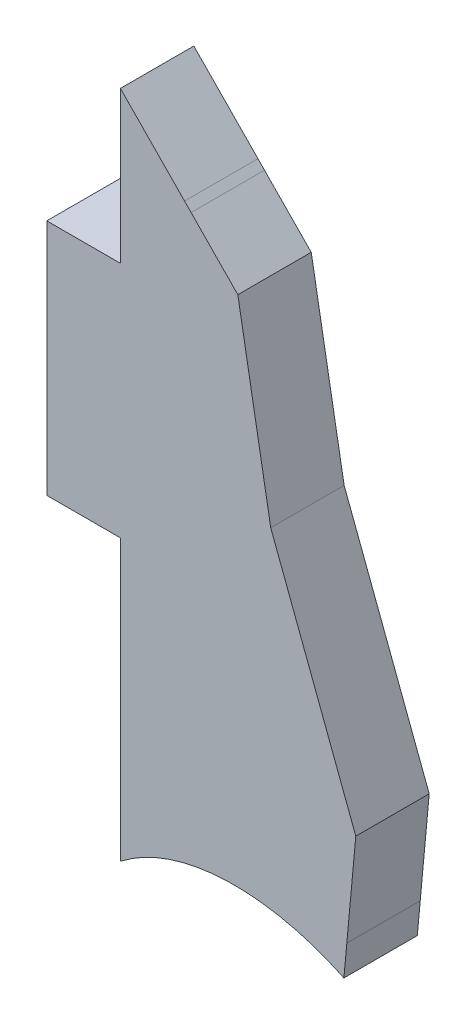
ISO-10303-21;
HEADER;
FILE_DESCRIPTION(('STEP AP214'),'2;1');
FILE_NAME('part.step','',(''),(''),'','','');
FILE_SCHEMA(('AUTOMOTIVE_DESIGN { 1 0 10303 214 1 1 1 1 }'));
ENDSEC;
DATA;
#1=APPLICATION_CONTEXT('core data for automotive mechanical design processes');
#2=APPLICATION_PROTOCOL_DEFINITION('international standard','automotive_design',2000,#1);
#3=PRODUCT_CONTEXT('',#1,'mechanical');
#4=PRODUCT('Part','Part','',(#3));
#5=PRODUCT_RELATED_PRODUCT_CATEGORY('part','',(#4));
#6=PRODUCT_DEFINITION_FORMATION('','',#4);
#7=PRODUCT_DEFINITION_CONTEXT('part definition',#1,'design');
#8=PRODUCT_DEFINITION('design','',#6,#7);
#9=PRODUCT_DEFINITION_SHAPE('','',#8);
#10=(LENGTH_UNIT() NAMED_UNIT(*) SI_UNIT(.MILLI.,.METRE.));
#11=(NAMED_UNIT(*) PLANE_ANGLE_UNIT() SI_UNIT($,.RADIAN.));
#12=(NAMED_UNIT(*) SI_UNIT($,.STERADIAN.) SOLID_ANGLE_UNIT());
#13=UNCERTAINTY_MEASURE_WITH_UNIT(LENGTH_MEASURE(1.E-05),#10,'distance_accuracy_value','');
#14=(GEOMETRIC_REPRESENTATION_CONTEXT(3) GLOBAL_UNCERTAINTY_ASSIGNED_CONTEXT((#13)) GLOBAL_UNIT_ASSIGNED_CONTEXT((#10,
#11,#12)) REPRESENTATION_CONTEXT('',''));
#15=CARTESIAN_POINT('',(0.,0.,0.));
#16=DIRECTION('',(0.,0.,1.));
#17=DIRECTION('',(1.,0.,0.));
#18=AXIS2_PLACEMENT_3D('',#15,#16,#17);
#19=CARTESIAN_POINT('',(332.35258045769,554.016328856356,3.));
#20=DIRECTION('',(-0.714557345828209,-0.699576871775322,0.));
#21=DIRECTION('',(0.699576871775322,-0.714557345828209,0.));
#22=AXIS2_PLACEMENT_3D('',#19,#20,#21);
#23=PLANE('',#22);
#24=DIRECTION('',(-0.699576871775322,0.714557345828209,0.));
#25=VECTOR('',#24,1.);
#26=CARTESIAN_POINT('',(332.35258045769,554.016328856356,0.));
#27=LINE('',#26,#25);
#28=CARTESIAN_POINT('',(332.620049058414,553.743132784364,0.));
#29=VERTEX_POINT('',#28);
#30=CARTESIAN_POINT('',(332.35258045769,554.016328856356,0.));
#31=VERTEX_POINT('',#30);
#32=EDGE_CURVE('E11',#29,#31,#27,.T.);
#33=ORIENTED_EDGE('',*,*,#32,.T.);
#34=DIRECTION('',(0.,0.,-1.));
#35=VECTOR('',#34,1.);
#36=CARTESIAN_POINT('',(332.35258045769,554.016328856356,3.));
#37=LINE('',#36,#35);
#38=CARTESIAN_POINT('',(332.35258045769,554.016328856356,3.));
#39=VERTEX_POINT('',#38);
#40=EDGE_CURVE('E394',#39,#31,#37,.T.);
#41=ORIENTED_EDGE('',*,*,#40,.F.);
#42=DIRECTION('',(-0.699576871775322,0.714557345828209,0.));
#43=VECTOR('',#42,1.);
#44=CARTESIAN_POINT('',(332.35258045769,554.016328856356,3.));
#45=LINE('',#44,#43);
#46=CARTESIAN_POINT('',(332.620049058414,553.743132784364,3.));
#47=VERTEX_POINT('',#46);
#48=EDGE_CURVE('E47',#47,#39,#45,.T.);
#49=ORIENTED_EDGE('',*,*,#48,.F.);
#50=DIRECTION('',(0.,0.,-1.));
#51=VECTOR('',#50,1.);
#52=CARTESIAN_POINT('',(332.620049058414,553.743132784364,3.));
#53=LINE('',#52,#51);
#54=EDGE_CURVE('E196',#47,#29,#53,.T.);
#55=ORIENTED_EDGE('',*,*,#54,.T.);
#56=EDGE_LOOP('',(#33,#41,#49,#55));
#57=FACE_BOUND('',#56,.T.);
#58=ADVANCED_FACE('F44',(#57),#23,.F.);
#59=CARTESIAN_POINT('',(329.732283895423,556.693340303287,3.));
#60=DIRECTION('',(-0.714636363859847,-0.699496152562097,0.));
#61=DIRECTION('',(0.699496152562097,-0.714636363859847,0.));
#62=AXIS2_PLACEMENT_3D('',#59,#60,#61);
#63=PLANE('',#62);
#64=DIRECTION('',(-0.699496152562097,0.714636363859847,0.));
#65=VECTOR('',#64,1.);
#66=CARTESIAN_POINT('',(329.732283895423,556.693340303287,0.));
#67=LINE('',#66,#65);
#68=CARTESIAN_POINT('',(329.732283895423,556.693340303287,0.));
#69=VERTEX_POINT('',#68);
#70=EDGE_CURVE('E57',#31,#69,#67,.T.);
#71=ORIENTED_EDGE('',*,*,#70,.T.);
#72=DIRECTION('',(0.,0.,-1.));
#73=VECTOR('',#72,1.);
#74=CARTESIAN_POINT('',(329.732283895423,556.693340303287,3.));
#75=LINE('',#74,#73);
#76=CARTESIAN_POINT('',(329.732283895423,556.693340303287,3.));
#77=VERTEX_POINT('',#76);
#78=EDGE_CURVE('E166',#77,#69,#75,.T.);
#79=ORIENTED_EDGE('',*,*,#78,.F.);
#80=DIRECTION('',(-0.699496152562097,0.714636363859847,0.));
#81=VECTOR('',#80,1.);
#82=CARTESIAN_POINT('',(329.732283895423,556.693340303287,3.));
#83=LINE('',#82,#81);
#84=EDGE_CURVE('E113',#39,#77,#83,.T.);
#85=ORIENTED_EDGE('',*,*,#84,.F.);
#86=ORIENTED_EDGE('',*,*,#40,.T.);
#87=EDGE_LOOP('',(#71,#79,#85,#86));
#88=FACE_BOUND('',#87,.T.);
#89=ADVANCED_FACE('F265',(#88),#63,.F.);
#90=CARTESIAN_POINT('',(329.732283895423,550.501470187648,3.));
#91=DIRECTION('',(1.,0.,0.));
#92=DIRECTION('',(0.,0.,-1.));
#93=AXIS2_PLACEMENT_3D('',#90,#91,#92);
#94=PLANE('',#93);
#95=DIRECTION('',(0.,-1.,0.));
#96=VECTOR('',#95,1.);
#97=CARTESIAN_POINT('',(329.732283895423,550.501470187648,0.));
#98=LINE('',#97,#96);
#99=CARTESIAN_POINT('',(329.732283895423,550.501470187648,0.));
#100=VERTEX_POINT('',#99);
#101=EDGE_CURVE('E162',#69,#100,#98,.T.);
#102=ORIENTED_EDGE('',*,*,#101,.T.);
#103=DIRECTION('',(0.,0.,-1.));
#104=VECTOR('',#103,1.);
#105=CARTESIAN_POINT('',(329.732283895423,550.501470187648,3.));
#106=LINE('',#105,#104);
#107=CARTESIAN_POINT('',(329.732283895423,550.501470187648,3.));
#108=VERTEX_POINT('',#107);
#109=EDGE_CURVE('E168',#108,#100,#106,.T.);
#110=ORIENTED_EDGE('',*,*,#109,.F.);
#111=DIRECTION('',(0.,-1.,0.));
#112=VECTOR('',#111,1.);
#113=CARTESIAN_POINT('',(329.732283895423,553.223870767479,3.));
#114=LINE('',#113,#112);
#115=EDGE_CURVE('E361',#77,#108,#114,.T.);
#116=ORIENTED_EDGE('',*,*,#115,.F.);
#117=ORIENTED_EDGE('',*,*,#78,.T.);
#118=EDGE_LOOP('',(#102,#110,#116,#117));
#119=FACE_BOUND('',#118,.T.);
#120=ADVANCED_FACE('F165',(#119),#94,.F.);
#121=CARTESIAN_POINT('',(326.723725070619,550.501470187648,3.));
#122=DIRECTION('',(0.,-1.,0.));
#123=DIRECTION('',(0.,0.,-1.));
#124=AXIS2_PLACEMENT_3D('',#121,#122,#123);
#125=PLANE('',#124);
#126=DIRECTION('',(-1.,0.,0.));
#127=VECTOR('',#126,1.);
#128=CARTESIAN_POINT('',(326.723725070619,550.501470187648,0.));
#129=LINE('',#128,#127);
#130=CARTESIAN_POINT('',(326.723725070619,550.501470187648,0.));
#131=VERTEX_POINT('',#130);
#132=EDGE_CURVE('E171',#100,#131,#129,.T.);
#133=ORIENTED_EDGE('',*,*,#132,.T.);
#134=DIRECTION('',(0.,0.,-1.));
#135=VECTOR('',#134,1.);
#136=CARTESIAN_POINT('',(326.723725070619,550.501470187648,3.));
#137=LINE('',#136,#135);
#138=CARTESIAN_POINT('',(326.723725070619,550.501470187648,3.));
#139=VERTEX_POINT('',#138);
#140=EDGE_CURVE('E177',#139,#131,#137,.T.);
#141=ORIENTED_EDGE('',*,*,#140,.F.);
#142=DIRECTION('',(-1.,0.,0.));
#143=VECTOR('',#142,1.);
#144=CARTESIAN_POINT('',(326.723725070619,550.501470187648,3.));
#145=LINE('',#144,#143);
#146=EDGE_CURVE('E180',#108,#139,#145,.T.);
#147=ORIENTED_EDGE('',*,*,#146,.F.);
#148=ORIENTED_EDGE('',*,*,#109,.T.);
#149=EDGE_LOOP('',(#133,#141,#147,#148));
#150=FACE_BOUND('',#149,.T.);
#151=ADVANCED_FACE('F172',(#150),#125,.F.);
#152=CARTESIAN_POINT('',(326.723725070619,540.784922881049,3.));
#153=DIRECTION('',(1.,0.,0.));
#154=DIRECTION('',(0.,0.,-1.));
#155=AXIS2_PLACEMENT_3D('',#152,#153,#154);
#156=PLANE('',#155);
#157=DIRECTION('',(0.,-1.,0.));
#158=VECTOR('',#157,1.);
#159=CARTESIAN_POINT('',(326.723725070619,540.784922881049,0.));
#160=LINE('',#159,#158);
#161=CARTESIAN_POINT('',(326.723725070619,540.784922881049,0.));
#162=VERTEX_POINT('',#161);
#163=EDGE_CURVE('E183',#131,#162,#160,.T.);
#164=ORIENTED_EDGE('',*,*,#163,.T.);
#165=DIRECTION('',(0.,0.,-1.));
#166=VECTOR('',#165,1.);
#167=CARTESIAN_POINT('',(326.723725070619,540.784922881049,3.));
#168=LINE('',#167,#166);
#169=CARTESIAN_POINT('',(326.723725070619,540.784922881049,3.));
#170=VERTEX_POINT('',#169);
#171=EDGE_CURVE('E292',#170,#162,#168,.T.);
#172=ORIENTED_EDGE('',*,*,#171,.F.);
#173=DIRECTION('',(0.,-1.,0.));
#174=VECTOR('',#173,1.);
#175=CARTESIAN_POINT('',(326.723725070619,540.784922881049,3.));
#176=LINE('',#175,#174);
#177=EDGE_CURVE('E370',#139,#170,#176,.T.);
#178=ORIENTED_EDGE('',*,*,#177,.F.);
#179=ORIENTED_EDGE('',*,*,#140,.T.);
#180=EDGE_LOOP('',(#164,#172,#178,#179));
#181=FACE_BOUND('',#180,.T.);
#182=ADVANCED_FACE('F274',(#181),#156,.F.);
#183=CARTESIAN_POINT('',(329.732283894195,540.784922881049,3.));
#184=DIRECTION('',(0.,1.,0.));
#185=DIRECTION('',(0.,0.,1.));
#186=AXIS2_PLACEMENT_3D('',#183,#184,#185);
#187=PLANE('',#186);
#188=DIRECTION('',(1.,0.,0.));
#189=VECTOR('',#188,1.);
#190=CARTESIAN_POINT('',(329.732283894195,540.784922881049,0.));
#191=LINE('',#190,#189);
#192=CARTESIAN_POINT('',(329.732283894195,540.784922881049,0.));
#193=VERTEX_POINT('',#192);
#194=EDGE_CURVE('E189',#162,#193,#191,.T.);
#195=ORIENTED_EDGE('',*,*,#194,.T.);
#196=DIRECTION('',(0.,0.,-1.));
#197=VECTOR('',#196,1.);
#198=CARTESIAN_POINT('',(329.732283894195,540.784922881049,3.));
#199=LINE('',#198,#197);
#200=CARTESIAN_POINT('',(329.732283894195,540.784922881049,3.));
#201=VERTEX_POINT('',#200);
#202=EDGE_CURVE('E286',#201,#193,#199,.T.);
#203=ORIENTED_EDGE('',*,*,#202,.F.);
#204=DIRECTION('',(1.,0.,0.));
#205=VECTOR('',#204,1.);
#206=CARTESIAN_POINT('',(329.732283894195,540.784922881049,3.));
#207=LINE('',#206,#205);
#208=EDGE_CURVE('E369',#170,#201,#207,.T.);
#209=ORIENTED_EDGE('',*,*,#208,.F.);
#210=ORIENTED_EDGE('',*,*,#171,.T.);
#211=EDGE_LOOP('',(#195,#203,#209,#210));
#212=FACE_BOUND('',#211,.T.);
#213=ADVANCED_FACE('F279',(#212),#187,.F.);
#214=CARTESIAN_POINT('',(329.732283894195,529.339626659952,3.));
#215=DIRECTION('',(1.,0.,0.));
#216=DIRECTION('',(0.,0.,-1.));
#217=AXIS2_PLACEMENT_3D('',#214,#215,#216);
#218=PLANE('',#217);
#219=DIRECTION('',(0.,-1.,0.));
#220=VECTOR('',#219,1.);
#221=CARTESIAN_POINT('',(329.732283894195,529.339626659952,0.));
#222=LINE('',#221,#220);
#223=CARTESIAN_POINT('',(329.732283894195,529.339626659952,0.));
#224=VERTEX_POINT('',#223);
#225=EDGE_CURVE('E295',#193,#224,#222,.T.);
#226=ORIENTED_EDGE('',*,*,#225,.T.);
#227=DIRECTION('',(0.,0.,-1.));
#228=VECTOR('',#227,1.);
#229=CARTESIAN_POINT('',(329.732283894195,529.339626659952,3.));
#230=LINE('',#229,#228);
#231=CARTESIAN_POINT('',(329.732283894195,529.339626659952,3.));
#232=VERTEX_POINT('',#231);
#233=EDGE_CURVE('E296',#232,#224,#230,.T.);
#234=ORIENTED_EDGE('',*,*,#233,.F.);
#235=DIRECTION('',(0.,-1.,0.));
#236=VECTOR('',#235,1.);
#237=CARTESIAN_POINT('',(329.732283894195,535.424698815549,3.));
#238=LINE('',#237,#236);
#239=EDGE_CURVE('E224',#201,#232,#238,.T.);
#240=ORIENTED_EDGE('',*,*,#239,.F.);
#241=ORIENTED_EDGE('',*,*,#202,.T.);
#242=EDGE_LOOP('',(#226,#234,#240,#241));
#243=FACE_BOUND('',#242,.T.);
#244=ADVANCED_FACE('F231',(#243),#218,.F.);
#245=CARTESIAN_POINT('',(329.732283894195,529.339626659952,3.));
#246=CARTESIAN_POINT('',(332.245050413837,531.293943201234,3.));
#247=CARTESIAN_POINT('',(335.864295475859,531.160359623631,3.));
#248=CARTESIAN_POINT('',(338.655081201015,529.872324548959,3.));
#249=B_SPLINE_CURVE_WITH_KNOTS('',3,(#245,#246,#247,#248),.UNSPECIFIED.,.F.,.F.,(4,4),(7.,8.),.UNSPECIFIED.);
#250=DIRECTION('',(0.,0.,-1.));
#251=VECTOR('',#250,1.);
#252=SURFACE_OF_LINEAR_EXTRUSION('',#249,#251);
#253=CARTESIAN_POINT('',(329.732283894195,529.339626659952,0.));
#254=CARTESIAN_POINT('',(332.245050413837,531.293943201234,0.));
#255=CARTESIAN_POINT('',(335.864295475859,531.160359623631,0.));
#256=CARTESIAN_POINT('',(338.655081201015,529.872324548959,0.));
#257=B_SPLINE_CURVE_WITH_KNOTS('',3,(#253,#254,#255,#256),.UNSPECIFIED.,.F.,.F.,(4,4),(7.,8.),.UNSPECIFIED.);
#258=CARTESIAN_POINT('',(338.655081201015,529.872324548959,0.));
#259=VERTEX_POINT('',#258);
#260=EDGE_CURVE('E352',#224,#259,#257,.T.);
#261=ORIENTED_EDGE('',*,*,#260,.T.);
#262=DIRECTION('',(0.,0.,-1.));
#263=VECTOR('',#262,1.);
#264=CARTESIAN_POINT('',(338.655081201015,529.872324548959,3.));
#265=LINE('',#264,#263);
#266=CARTESIAN_POINT('',(338.655081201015,529.872324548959,3.));
#267=VERTEX_POINT('',#266);
#268=EDGE_CURVE('E305',#267,#259,#265,.T.);
#269=ORIENTED_EDGE('',*,*,#268,.F.);
#270=EDGE_CURVE('E218',#232,#267,#249,.T.);
#271=ORIENTED_EDGE('',*,*,#270,.F.);
#272=ORIENTED_EDGE('',*,*,#233,.T.);
#273=EDGE_LOOP('',(#261,#269,#271,#272));
#274=FACE_BOUND('',#273,.T.);
#275=ADVANCED_FACE('F226',(#274),#252,.F.);
#276=CARTESIAN_POINT('',(338.864586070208,529.7756034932,3.));
#277=DIRECTION('',(0.419152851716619,0.907915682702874,0.));
#278=DIRECTION('',(-0.907915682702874,0.419152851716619,0.));
#279=AXIS2_PLACEMENT_3D('',#276,#277,#278);
#280=PLANE('',#279);
#281=DIRECTION('',(0.907915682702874,-0.419152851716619,0.));
#282=VECTOR('',#281,1.);
#283=CARTESIAN_POINT('',(338.864586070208,529.7756034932,0.));
#284=LINE('',#283,#282);
#285=CARTESIAN_POINT('',(338.864586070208,529.7756034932,0.));
#286=VERTEX_POINT('',#285);
#287=EDGE_CURVE('E346',#259,#286,#284,.T.);
#288=ORIENTED_EDGE('',*,*,#287,.T.);
#289=DIRECTION('',(0.,0.,-1.));
#290=VECTOR('',#289,1.);
#291=CARTESIAN_POINT('',(338.864586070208,529.7756034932,3.));
#292=LINE('',#291,#290);
#293=CARTESIAN_POINT('',(338.864586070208,529.7756034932,3.));
#294=VERTEX_POINT('',#293);
#295=EDGE_CURVE('E309',#294,#286,#292,.T.);
#296=ORIENTED_EDGE('',*,*,#295,.F.);
#297=DIRECTION('',(0.907915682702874,-0.419152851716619,0.));
#298=VECTOR('',#297,1.);
#299=CARTESIAN_POINT('',(338.864586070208,529.7756034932,3.));
#300=LINE('',#299,#298);
#301=EDGE_CURVE('E215',#267,#294,#300,.T.);
#302=ORIENTED_EDGE('',*,*,#301,.F.);
#303=ORIENTED_EDGE('',*,*,#268,.T.);
#304=EDGE_LOOP('',(#288,#296,#302,#303));
#305=FACE_BOUND('',#304,.T.);
#306=ADVANCED_FACE('F235',(#305),#280,.F.);
#307=CARTESIAN_POINT('',(338.984087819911,531.0679449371,3.));
#308=DIRECTION('',(-0.995751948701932,0.0920763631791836,0.));
#309=DIRECTION('',(-0.0920763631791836,-0.995751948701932,0.));
#310=AXIS2_PLACEMENT_3D('',#307,#308,#309);
#311=PLANE('',#310);
#312=DIRECTION('',(0.0920763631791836,0.995751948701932,0.));
#313=VECTOR('',#312,1.);
#314=CARTESIAN_POINT('',(338.984087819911,531.0679449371,0.));
#315=LINE('',#314,#313);
#316=CARTESIAN_POINT('',(338.984087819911,531.0679449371,0.));
#317=VERTEX_POINT('',#316);
#318=EDGE_CURVE('E342',#286,#317,#315,.T.);
#319=ORIENTED_EDGE('',*,*,#318,.T.);
#320=DIRECTION('',(0.,0.,-1.));
#321=VECTOR('',#320,1.);
#322=CARTESIAN_POINT('',(338.984087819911,531.0679449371,3.));
#323=LINE('',#322,#321);
#324=CARTESIAN_POINT('',(338.984087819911,531.0679449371,3.));
#325=VERTEX_POINT('',#324);
#326=EDGE_CURVE('E313',#325,#317,#323,.T.);
#327=ORIENTED_EDGE('',*,*,#326,.F.);
#328=DIRECTION('',(0.0920763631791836,0.995751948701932,0.));
#329=VECTOR('',#328,1.);
#330=CARTESIAN_POINT('',(338.984087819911,531.0679449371,3.));
#331=LINE('',#330,#329);
#332=EDGE_CURVE('E208',#294,#325,#331,.T.);
#333=ORIENTED_EDGE('',*,*,#332,.F.);
#334=ORIENTED_EDGE('',*,*,#295,.T.);
#335=EDGE_LOOP('',(#319,#327,#333,#334));
#336=FACE_BOUND('',#335,.T.);
#337=ADVANCED_FACE('F238',(#336),#311,.F.);
#338=CARTESIAN_POINT('',(339.351162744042,535.037814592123,3.));
#339=DIRECTION('',(-0.995752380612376,0.0920716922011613,0.));
#340=DIRECTION('',(-0.0920716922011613,-0.995752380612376,0.));
#341=AXIS2_PLACEMENT_3D('',#338,#339,#340);
#342=PLANE('',#341);
#343=DIRECTION('',(0.0920716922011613,0.995752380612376,0.));
#344=VECTOR('',#343,1.);
#345=CARTESIAN_POINT('',(339.351162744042,535.037814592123,0.));
#346=LINE('',#345,#344);
#347=CARTESIAN_POINT('',(339.017419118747,531.428388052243,0.));
#348=VERTEX_POINT('',#347);
#349=CARTESIAN_POINT('',(339.351162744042,535.037814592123,0.));
#350=VERTEX_POINT('',#349);
#351=EDGE_CURVE('E339',#348,#350,#346,.T.);
#352=ORIENTED_EDGE('',*,*,#351,.T.);
#353=DIRECTION('',(0.,0.,-1.));
#354=VECTOR('',#353,1.);
#355=CARTESIAN_POINT('',(339.351162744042,535.037814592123,3.));
#356=LINE('',#355,#354);
#357=CARTESIAN_POINT('',(339.351162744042,535.037814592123,3.));
#358=VERTEX_POINT('',#357);
#359=EDGE_CURVE('E319',#358,#350,#356,.T.);
#360=ORIENTED_EDGE('',*,*,#359,.F.);
#361=DIRECTION('',(0.0920716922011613,0.995752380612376,0.));
#362=VECTOR('',#361,1.);
#363=CARTESIAN_POINT('',(339.351162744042,535.037814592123,3.));
#364=LINE('',#363,#362);
#365=CARTESIAN_POINT('',(339.017419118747,531.428388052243,3.));
#366=VERTEX_POINT('',#365);
#367=EDGE_CURVE('E201',#366,#358,#364,.T.);
#368=ORIENTED_EDGE('',*,*,#367,.F.);
#369=DIRECTION('',(0.0920802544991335,0.99575158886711,0.));
#370=VECTOR('',#369,1.);
#371=CARTESIAN_POINT('',(339.017419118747,531.428388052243,3.));
#372=LINE('',#371,#370);
#373=EDGE_CURVE('E210',#325,#366,#372,.T.);
#374=ORIENTED_EDGE('',*,*,#373,.F.);
#375=ORIENTED_EDGE('',*,*,#326,.T.);
#376=DIRECTION('',(0.0920802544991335,0.99575158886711,0.));
#377=VECTOR('',#376,1.);
#378=CARTESIAN_POINT('',(339.017419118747,531.428388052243,0.));
#379=LINE('',#378,#377);
#380=EDGE_CURVE('E341',#317,#348,#379,.T.);
#381=ORIENTED_EDGE('',*,*,#380,.T.);
#382=EDGE_LOOP('',(#352,#360,#368,#374,#375,#381));
#383=FACE_BOUND('',#382,.T.);
#384=ADVANCED_FACE('F245',(#383),#342,.F.);
#385=CARTESIAN_POINT('',(335.875492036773,544.213568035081,3.));
#386=DIRECTION('',(-0.935159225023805,-0.354227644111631,0.));
#387=DIRECTION('',(0.354227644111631,-0.935159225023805,0.));
#388=AXIS2_PLACEMENT_3D('',#385,#386,#387);
#389=PLANE('',#388);
#390=DIRECTION('',(-0.354227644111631,0.935159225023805,0.));
#391=VECTOR('',#390,1.);
#392=CARTESIAN_POINT('',(335.875492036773,544.213568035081,0.));
#393=LINE('',#392,#391);
#394=CARTESIAN_POINT('',(335.875492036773,544.213568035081,0.));
#395=VERTEX_POINT('',#394);
#396=EDGE_CURVE('E337',#350,#395,#393,.T.);
#397=ORIENTED_EDGE('',*,*,#396,.T.);
#398=DIRECTION('',(0.,0.,-1.));
#399=VECTOR('',#398,1.);
#400=CARTESIAN_POINT('',(335.875492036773,544.213568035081,3.));
#401=LINE('',#400,#399);
#402=CARTESIAN_POINT('',(335.875492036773,544.213568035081,3.));
#403=VERTEX_POINT('',#402);
#404=EDGE_CURVE('E321',#403,#395,#401,.T.);
#405=ORIENTED_EDGE('',*,*,#404,.F.);
#406=DIRECTION('',(-0.354227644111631,0.935159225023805,0.));
#407=VECTOR('',#406,1.);
#408=CARTESIAN_POINT('',(335.875492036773,544.213568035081,3.));
#409=LINE('',#408,#407);
#410=EDGE_CURVE('E202',#358,#403,#409,.T.);
#411=ORIENTED_EDGE('',*,*,#410,.F.);
#412=ORIENTED_EDGE('',*,*,#359,.T.);
#413=EDGE_LOOP('',(#397,#405,#411,#412));
#414=FACE_BOUND('',#413,.T.);
#415=ADVANCED_FACE('F246',(#414),#389,.F.);
#416=CARTESIAN_POINT('',(334.530354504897,551.791486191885,3.));
#417=DIRECTION('',(-0.984608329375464,-0.174775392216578,0.));
#418=DIRECTION('',(0.174775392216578,-0.984608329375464,0.));
#419=AXIS2_PLACEMENT_3D('',#416,#417,#418);
#420=PLANE('',#419);
#421=DIRECTION('',(-0.174775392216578,0.984608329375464,0.));
#422=VECTOR('',#421,1.);
#423=CARTESIAN_POINT('',(334.530354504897,551.791486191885,0.));
#424=LINE('',#423,#422);
#425=CARTESIAN_POINT('',(334.530354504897,551.791486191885,0.));
#426=VERTEX_POINT('',#425);
#427=EDGE_CURVE('E335',#395,#426,#424,.T.);
#428=ORIENTED_EDGE('',*,*,#427,.T.);
#429=DIRECTION('',(0.,0.,-1.));
#430=VECTOR('',#429,1.);
#431=CARTESIAN_POINT('',(334.530354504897,551.791486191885,3.));
#432=LINE('',#431,#430);
#433=CARTESIAN_POINT('',(334.530354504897,551.791486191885,3.));
#434=VERTEX_POINT('',#433);
#435=EDGE_CURVE('E328',#434,#426,#432,.T.);
#436=ORIENTED_EDGE('',*,*,#435,.F.);
#437=DIRECTION('',(-0.174775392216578,0.984608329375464,0.));
#438=VECTOR('',#437,1.);
#439=CARTESIAN_POINT('',(334.530354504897,551.791486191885,3.));
#440=LINE('',#439,#438);
#441=EDGE_CURVE('E200',#403,#434,#440,.T.);
#442=ORIENTED_EDGE('',*,*,#441,.F.);
#443=ORIENTED_EDGE('',*,*,#404,.T.);
#444=EDGE_LOOP('',(#428,#436,#442,#443));
#445=FACE_BOUND('',#444,.T.);
#446=ADVANCED_FACE('F249',(#445),#420,.F.);
#447=CARTESIAN_POINT('',(332.620049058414,553.743132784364,3.));
#448=DIRECTION('',(-0.71463522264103,-0.699497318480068,0.));
#449=DIRECTION('',(0.699497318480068,-0.71463522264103,0.));
#450=AXIS2_PLACEMENT_3D('',#447,#448,#449);
#451=PLANE('',#450);
#452=DIRECTION('',(-0.699497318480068,0.71463522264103,0.));
#453=VECTOR('',#452,1.);
#454=CARTESIAN_POINT('',(332.620049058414,553.743132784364,0.));
#455=LINE('',#454,#453);
#456=EDGE_CURVE('E121',#426,#29,#455,.T.);
#457=ORIENTED_EDGE('',*,*,#456,.T.);
#458=ORIENTED_EDGE('',*,*,#54,.F.);
#459=DIRECTION('',(-0.699497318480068,0.71463522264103,0.));
#460=VECTOR('',#459,1.);
#461=CARTESIAN_POINT('',(332.620049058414,553.743132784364,3.));
#462=LINE('',#461,#460);
#463=EDGE_CURVE('E193',#434,#47,#462,.T.);
#464=ORIENTED_EDGE('',*,*,#463,.F.);
#465=ORIENTED_EDGE('',*,*,#435,.T.);
#466=EDGE_LOOP('',(#457,#458,#464,#465));
#467=FACE_BOUND('',#466,.T.);
#468=ADVANCED_FACE('F251',(#467),#451,.F.);
#469=CARTESIAN_POINT('',(334.089425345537,530.821857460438,3.));
#470=DIRECTION('',(0.,0.,-1.));
#471=DIRECTION('',(-1.,0.,0.));
#472=AXIS2_PLACEMENT_3D('',#469,#470,#471);
#473=PLANE('',#472);
#474=ORIENTED_EDGE('',*,*,#48,.T.);
#475=ORIENTED_EDGE('',*,*,#84,.T.);
#476=ORIENTED_EDGE('',*,*,#115,.T.);
#477=ORIENTED_EDGE('',*,*,#146,.T.);
#478=ORIENTED_EDGE('',*,*,#177,.T.);
#479=ORIENTED_EDGE('',*,*,#208,.T.);
#480=ORIENTED_EDGE('',*,*,#239,.T.);
#481=ORIENTED_EDGE('',*,*,#270,.T.);
#482=ORIENTED_EDGE('',*,*,#301,.T.);
#483=ORIENTED_EDGE('',*,*,#332,.T.);
#484=ORIENTED_EDGE('',*,*,#373,.T.);
#485=ORIENTED_EDGE('',*,*,#367,.T.);
#486=ORIENTED_EDGE('',*,*,#410,.T.);
#487=ORIENTED_EDGE('',*,*,#441,.T.);
#488=ORIENTED_EDGE('',*,*,#463,.T.);
#489=EDGE_LOOP('',(#474,#475,#476,#477,#478,#479,#480,#481,#482,#483,#484,#485,#486,#487,#488));
#490=FACE_BOUND('',#489,.T.);
#491=ADVANCED_FACE('F50',(#490),#473,.F.);
#492=CARTESIAN_POINT('',(334.089425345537,530.821857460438,0.));
#493=DIRECTION('',(0.,0.,-1.));
#494=DIRECTION('',(-1.,0.,0.));
#495=AXIS2_PLACEMENT_3D('',#492,#493,#494);
#496=PLANE('',#495);
#497=ORIENTED_EDGE('',*,*,#32,.F.);
#498=ORIENTED_EDGE('',*,*,#456,.F.);
#499=ORIENTED_EDGE('',*,*,#427,.F.);
#500=ORIENTED_EDGE('',*,*,#396,.F.);
#501=ORIENTED_EDGE('',*,*,#351,.F.);
#502=ORIENTED_EDGE('',*,*,#380,.F.);
#503=ORIENTED_EDGE('',*,*,#318,.F.);
#504=ORIENTED_EDGE('',*,*,#287,.F.);
#505=ORIENTED_EDGE('',*,*,#260,.F.);
#506=ORIENTED_EDGE('',*,*,#225,.F.);
#507=ORIENTED_EDGE('',*,*,#194,.F.);
#508=ORIENTED_EDGE('',*,*,#163,.F.);
#509=ORIENTED_EDGE('',*,*,#132,.F.);
#510=ORIENTED_EDGE('',*,*,#101,.F.);
#511=ORIENTED_EDGE('',*,*,#70,.F.);
#512=EDGE_LOOP('',(#497,#498,#499,#500,#501,#502,#503,#504,#505,#506,#507,#508,#509,#510,#511));
#513=FACE_BOUND('',#512,.T.);
#514=ADVANCED_FACE('F185',(#513),#496,.T.);
#515=CLOSED_SHELL('',(#58,#89,#120,#151,#182,#213,#244,#275,#306,#337,#384,#415,#446,#468,#491,#514));
#516=MANIFOLD_SOLID_BREP('B2',#515);
#517=ADVANCED_BREP_SHAPE_REPRESENTATION('',(#18,#516),#14);
#518=SHAPE_DEFINITION_REPRESENTATION(#9,#517);
ENDSEC;
END-ISO-10303-21;
